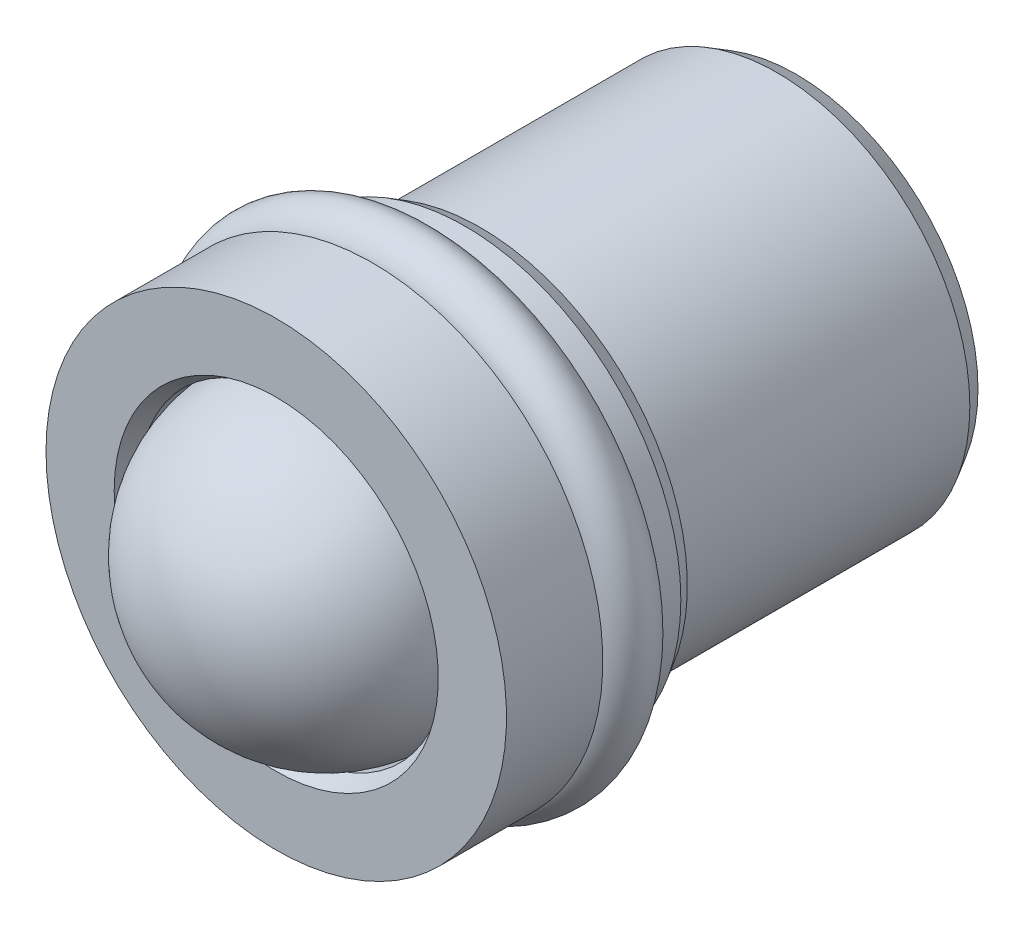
ISO-10303-21;
HEADER;
FILE_DESCRIPTION(('STEP AP214'),'2;1');
FILE_NAME('part.step','',(''),(''),'','','');
FILE_SCHEMA(('AUTOMOTIVE_DESIGN { 1 0 10303 214 1 1 1 1 }'));
ENDSEC;
DATA;
#1=APPLICATION_CONTEXT('core data for automotive mechanical design processes');
#2=APPLICATION_PROTOCOL_DEFINITION('international standard','automotive_design',2000,#1);
#3=PRODUCT_CONTEXT('',#1,'mechanical');
#4=PRODUCT('Part','Part','',(#3));
#5=PRODUCT_RELATED_PRODUCT_CATEGORY('part','',(#4));
#6=PRODUCT_DEFINITION_FORMATION('','',#4);
#7=PRODUCT_DEFINITION_CONTEXT('part definition',#1,'design');
#8=PRODUCT_DEFINITION('design','',#6,#7);
#9=PRODUCT_DEFINITION_SHAPE('','',#8);
#10=(LENGTH_UNIT() NAMED_UNIT(*) SI_UNIT(.MILLI.,.METRE.));
#11=(NAMED_UNIT(*) PLANE_ANGLE_UNIT() SI_UNIT($,.RADIAN.));
#12=(NAMED_UNIT(*) SI_UNIT($,.STERADIAN.) SOLID_ANGLE_UNIT());
#13=UNCERTAINTY_MEASURE_WITH_UNIT(LENGTH_MEASURE(1.E-05),#10,'distance_accuracy_value','');
#14=(GEOMETRIC_REPRESENTATION_CONTEXT(3) GLOBAL_UNCERTAINTY_ASSIGNED_CONTEXT((#13)) GLOBAL_UNIT_ASSIGNED_CONTEXT((#10,
#11,#12)) REPRESENTATION_CONTEXT('',''));
#15=CARTESIAN_POINT('',(0.,0.,0.));
#16=DIRECTION('',(0.,0.,1.));
#17=DIRECTION('',(1.,0.,0.));
#18=AXIS2_PLACEMENT_3D('',#15,#16,#17);
#19=CARTESIAN_POINT('',(0.,0.,-7.7));
#20=DIRECTION('',(0.,0.,1.));
#21=DIRECTION('',(1.,0.,0.));
#22=AXIS2_PLACEMENT_3D('',#19,#20,#21);
#23=CONICAL_SURFACE('',#22,5.,0.523598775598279);
#24=CARTESIAN_POINT('',(0.,0.,-8.2));
#25=DIRECTION('',(0.,0.,-1.));
#26=DIRECTION('',(-1.,0.,0.));
#27=AXIS2_PLACEMENT_3D('',#24,#25,#26);
#28=CIRCLE('',#27,4.7113248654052);
#29=CARTESIAN_POINT('',(-4.7113248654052,0.,-8.2));
#30=VERTEX_POINT('',#29);
#31=EDGE_CURVE('E18',#30,#30,#28,.T.);
#32=ORIENTED_EDGE('',*,*,#31,.F.);
#33=EDGE_LOOP('',(#32));
#34=FACE_BOUND('',#33,.T.);
#35=CARTESIAN_POINT('',(0.,0.,-7.7));
#36=DIRECTION('',(0.,0.,-1.));
#37=DIRECTION('',(-1.,0.,0.));
#38=AXIS2_PLACEMENT_3D('',#35,#36,#37);
#39=CIRCLE('',#38,5.);
#40=CARTESIAN_POINT('',(-5.,0.,-7.7));
#41=VERTEX_POINT('',#40);
#42=EDGE_CURVE('E70',#41,#41,#39,.T.);
#43=ORIENTED_EDGE('',*,*,#42,.T.);
#44=EDGE_LOOP('',(#43));
#45=FACE_BOUND('',#44,.T.);
#46=ADVANCED_FACE('F12',(#34,#45),#23,.T.);
#47=CARTESIAN_POINT('',(0.,4.7113248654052,-8.2));
#48=DIRECTION('',(0.,0.,1.));
#49=DIRECTION('',(1.,0.,0.));
#50=AXIS2_PLACEMENT_3D('',#47,#48,#49);
#51=PLANE('',#50);
#52=ORIENTED_EDGE('',*,*,#31,.T.);
#53=EDGE_LOOP('',(#52));
#54=FACE_BOUND('',#53,.T.);
#55=ADVANCED_FACE('F168',(#54),#51,.F.);
#56=CARTESIAN_POINT('',(0.,0.,5.3));
#57=DIRECTION('',(0.,0.,-1.));
#58=DIRECTION('',(-1.,0.,0.));
#59=AXIS2_PLACEMENT_3D('',#56,#57,#58);
#60=CYLINDRICAL_SURFACE('',#59,3.975);
#61=CARTESIAN_POINT('',(0.,0.,4.4465142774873));
#62=DIRECTION('',(0.,0.,-1.));
#63=DIRECTION('',(-1.,0.,0.));
#64=AXIS2_PLACEMENT_3D('',#61,#62,#63);
#65=CIRCLE('',#64,3.975);
#66=CARTESIAN_POINT('',(-3.975,0.,4.4465142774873));
#67=VERTEX_POINT('',#66);
#68=EDGE_CURVE('E8',#67,#67,#65,.T.);
#69=ORIENTED_EDGE('',*,*,#68,.T.);
#70=EDGE_LOOP('',(#69));
#71=FACE_BOUND('',#70,.T.);
#72=CARTESIAN_POINT('',(0.,0.,4.9));
#73=DIRECTION('',(0.,0.,-1.));
#74=DIRECTION('',(-1.,0.,0.));
#75=AXIS2_PLACEMENT_3D('',#72,#73,#74);
#76=CIRCLE('',#75,3.975);
#77=CARTESIAN_POINT('',(-3.975,0.,4.9));
#78=VERTEX_POINT('',#77);
#79=EDGE_CURVE('E22',#78,#78,#76,.T.);
#80=ORIENTED_EDGE('',*,*,#79,.F.);
#81=EDGE_LOOP('',(#80));
#82=FACE_BOUND('',#81,.T.);
#83=ADVANCED_FACE('F163',(#71,#82),#60,.F.);
#84=CARTESIAN_POINT('',(0.,0.,4.9));
#85=DIRECTION('',(0.,0.,1.));
#86=DIRECTION('',(1.,0.,0.));
#87=AXIS2_PLACEMENT_3D('',#84,#85,#86);
#88=CONICAL_SURFACE('',#87,3.975,0.523598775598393);
#89=CARTESIAN_POINT('',(0.,0.,5.3));
#90=DIRECTION('',(0.,0.,-1.));
#91=DIRECTION('',(-1.,0.,0.));
#92=AXIS2_PLACEMENT_3D('',#89,#90,#91);
#93=CIRCLE('',#92,4.2059401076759);
#94=CARTESIAN_POINT('',(-4.2059401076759,0.,5.3));
#95=VERTEX_POINT('',#94);
#96=EDGE_CURVE('E26',#95,#95,#93,.T.);
#97=ORIENTED_EDGE('',*,*,#96,.F.);
#98=EDGE_LOOP('',(#97));
#99=FACE_BOUND('',#98,.T.);
#100=ORIENTED_EDGE('',*,*,#79,.T.);
#101=EDGE_LOOP('',(#100));
#102=FACE_BOUND('',#101,.T.);
#103=ADVANCED_FACE('F157',(#99,#102),#88,.F.);
#104=CARTESIAN_POINT('',(0.,4.2059401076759,5.3));
#105=DIRECTION('',(0.,0.,-1.));
#106=DIRECTION('',(-1.,0.,0.));
#107=AXIS2_PLACEMENT_3D('',#104,#105,#106);
#108=PLANE('',#107);
#109=CARTESIAN_POINT('',(0.,0.,5.3));
#110=DIRECTION('',(0.,0.,-1.));
#111=DIRECTION('',(-1.,0.,0.));
#112=AXIS2_PLACEMENT_3D('',#109,#110,#111);
#113=CIRCLE('',#112,5.975);
#114=CARTESIAN_POINT('',(-5.975,0.,5.3));
#115=VERTEX_POINT('',#114);
#116=EDGE_CURVE('E31',#115,#115,#113,.T.);
#117=ORIENTED_EDGE('',*,*,#116,.F.);
#118=EDGE_LOOP('',(#117));
#119=FACE_BOUND('',#118,.T.);
#120=ORIENTED_EDGE('',*,*,#96,.T.);
#121=EDGE_LOOP('',(#120));
#122=FACE_BOUND('',#121,.T.);
#123=ADVANCED_FACE('F151',(#119,#122),#108,.F.);
#124=CARTESIAN_POINT('',(0.,0.,5.3));
#125=DIRECTION('',(0.,0.,-1.));
#126=DIRECTION('',(-1.,0.,0.));
#127=AXIS2_PLACEMENT_3D('',#124,#125,#126);
#128=CYLINDRICAL_SURFACE('',#127,5.975);
#129=CARTESIAN_POINT('',(0.,0.,2.8));
#130=DIRECTION('',(0.,0.,-1.));
#131=DIRECTION('',(-1.,0.,0.));
#132=AXIS2_PLACEMENT_3D('',#129,#130,#131);
#133=CIRCLE('',#132,5.975);
#134=CARTESIAN_POINT('',(-5.975,0.,2.8));
#135=VERTEX_POINT('',#134);
#136=EDGE_CURVE('E34',#135,#135,#133,.T.);
#137=ORIENTED_EDGE('',*,*,#136,.F.);
#138=EDGE_LOOP('',(#137));
#139=FACE_BOUND('',#138,.T.);
#140=ORIENTED_EDGE('',*,*,#116,.T.);
#141=EDGE_LOOP('',(#140));
#142=FACE_BOUND('',#141,.T.);
#143=ADVANCED_FACE('F145',(#139,#142),#128,.T.);
#144=CARTESIAN_POINT('',(0.,5.975,2.8));
#145=DIRECTION('',(0.,0.,1.));
#146=DIRECTION('',(1.,0.,0.));
#147=AXIS2_PLACEMENT_3D('',#144,#145,#146);
#148=PLANE('',#147);
#149=CARTESIAN_POINT('',(0.,0.,2.8));
#150=DIRECTION('',(0.,0.,-1.));
#151=DIRECTION('',(-1.,0.,0.));
#152=AXIS2_PLACEMENT_3D('',#149,#150,#151);
#153=CIRCLE('',#152,4.825);
#154=CARTESIAN_POINT('',(-4.825,0.,2.8));
#155=VERTEX_POINT('',#154);
#156=EDGE_CURVE('E37',#155,#155,#153,.T.);
#157=ORIENTED_EDGE('',*,*,#156,.F.);
#158=EDGE_LOOP('',(#157));
#159=FACE_BOUND('',#158,.T.);
#160=ORIENTED_EDGE('',*,*,#136,.T.);
#161=EDGE_LOOP('',(#160));
#162=FACE_BOUND('',#161,.T.);
#163=ADVANCED_FACE('F139',(#159,#162),#148,.F.);
#164=CARTESIAN_POINT('',(0.,0.,5.3));
#165=DIRECTION('',(0.,0.,-1.));
#166=DIRECTION('',(-1.,0.,0.));
#167=AXIS2_PLACEMENT_3D('',#164,#165,#166);
#168=CYLINDRICAL_SURFACE('',#167,4.825);
#169=CARTESIAN_POINT('',(0.,0.,2.65));
#170=DIRECTION('',(0.,0.,-1.));
#171=DIRECTION('',(-1.,0.,0.));
#172=AXIS2_PLACEMENT_3D('',#169,#170,#171);
#173=CIRCLE('',#172,4.825);
#174=CARTESIAN_POINT('',(-4.825,0.,2.65));
#175=VERTEX_POINT('',#174);
#176=EDGE_CURVE('E40',#175,#175,#173,.T.);
#177=ORIENTED_EDGE('',*,*,#176,.F.);
#178=EDGE_LOOP('',(#177));
#179=FACE_BOUND('',#178,.T.);
#180=ORIENTED_EDGE('',*,*,#156,.T.);
#181=EDGE_LOOP('',(#180));
#182=FACE_BOUND('',#181,.T.);
#183=ADVANCED_FACE('F133',(#179,#182),#168,.T.);
#184=CARTESIAN_POINT('',(0.,4.825,2.65));
#185=DIRECTION('',(0.,0.,-1.));
#186=DIRECTION('',(-1.,0.,0.));
#187=AXIS2_PLACEMENT_3D('',#184,#185,#186);
#188=PLANE('',#187);
#189=CARTESIAN_POINT('',(0.,0.,2.65));
#190=DIRECTION('',(0.,0.,-1.));
#191=DIRECTION('',(-1.,0.,0.));
#192=AXIS2_PLACEMENT_3D('',#189,#190,#191);
#193=CIRCLE('',#192,5.575);
#194=CARTESIAN_POINT('',(-5.575,0.,2.65));
#195=VERTEX_POINT('',#194);
#196=EDGE_CURVE('E43',#195,#195,#193,.T.);
#197=ORIENTED_EDGE('',*,*,#196,.F.);
#198=EDGE_LOOP('',(#197));
#199=FACE_BOUND('',#198,.T.);
#200=ORIENTED_EDGE('',*,*,#176,.T.);
#201=EDGE_LOOP('',(#200));
#202=FACE_BOUND('',#201,.T.);
#203=ADVANCED_FACE('F127',(#199,#202),#188,.F.);
#204=CARTESIAN_POINT('',(0.,0.,1.9));
#205=DIRECTION('',(0.,0.,-1.));
#206=DIRECTION('',(-1.,0.,0.));
#207=AXIS2_PLACEMENT_3D('',#204,#205,#206);
#208=TOROIDAL_SURFACE('',#207,5.575,0.750000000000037);
#209=CARTESIAN_POINT('',(0.,0.,1.15));
#210=DIRECTION('',(0.,0.,-1.));
#211=DIRECTION('',(-1.,0.,0.));
#212=AXIS2_PLACEMENT_3D('',#209,#210,#211);
#213=CIRCLE('',#212,5.575);
#214=CARTESIAN_POINT('',(-5.575,0.,1.15));
#215=VERTEX_POINT('',#214);
#216=EDGE_CURVE('E46',#215,#215,#213,.T.);
#217=ORIENTED_EDGE('',*,*,#216,.F.);
#218=EDGE_LOOP('',(#217));
#219=FACE_BOUND('',#218,.T.);
#220=ORIENTED_EDGE('',*,*,#196,.T.);
#221=EDGE_LOOP('',(#220));
#222=FACE_BOUND('',#221,.T.);
#223=ADVANCED_FACE('F121',(#219,#222),#208,.T.);
#224=CARTESIAN_POINT('',(0.,5.575,1.15));
#225=DIRECTION('',(0.,0.,1.));
#226=DIRECTION('',(1.,0.,0.));
#227=AXIS2_PLACEMENT_3D('',#224,#225,#226);
#228=PLANE('',#227);
#229=CARTESIAN_POINT('',(0.,0.,1.15));
#230=DIRECTION('',(0.,0.,-1.));
#231=DIRECTION('',(-1.,0.,0.));
#232=AXIS2_PLACEMENT_3D('',#229,#230,#231);
#233=CIRCLE('',#232,4.825);
#234=CARTESIAN_POINT('',(-4.825,0.,1.15));
#235=VERTEX_POINT('',#234);
#236=EDGE_CURVE('E49',#235,#235,#233,.T.);
#237=ORIENTED_EDGE('',*,*,#236,.F.);
#238=EDGE_LOOP('',(#237));
#239=FACE_BOUND('',#238,.T.);
#240=ORIENTED_EDGE('',*,*,#216,.T.);
#241=EDGE_LOOP('',(#240));
#242=FACE_BOUND('',#241,.T.);
#243=ADVANCED_FACE('F115',(#239,#242),#228,.F.);
#244=CARTESIAN_POINT('',(0.,0.,5.3));
#245=DIRECTION('',(0.,0.,-1.));
#246=DIRECTION('',(-1.,0.,0.));
#247=AXIS2_PLACEMENT_3D('',#244,#245,#246);
#248=CYLINDRICAL_SURFACE('',#247,4.825);
#249=CARTESIAN_POINT('',(0.,0.,1.));
#250=DIRECTION('',(0.,0.,-1.));
#251=DIRECTION('',(-1.,0.,0.));
#252=AXIS2_PLACEMENT_3D('',#249,#250,#251);
#253=CIRCLE('',#252,4.825);
#254=CARTESIAN_POINT('',(-4.825,0.,1.));
#255=VERTEX_POINT('',#254);
#256=EDGE_CURVE('E52',#255,#255,#253,.T.);
#257=ORIENTED_EDGE('',*,*,#256,.F.);
#258=EDGE_LOOP('',(#257));
#259=FACE_BOUND('',#258,.T.);
#260=ORIENTED_EDGE('',*,*,#236,.T.);
#261=EDGE_LOOP('',(#260));
#262=FACE_BOUND('',#261,.T.);
#263=ADVANCED_FACE('F109',(#259,#262),#248,.T.);
#264=CARTESIAN_POINT('',(0.,4.825,1.));
#265=DIRECTION('',(0.,0.,-1.));
#266=DIRECTION('',(-1.,0.,0.));
#267=AXIS2_PLACEMENT_3D('',#264,#265,#266);
#268=PLANE('',#267);
#269=CARTESIAN_POINT('',(0.,0.,1.));
#270=DIRECTION('',(0.,0.,-1.));
#271=DIRECTION('',(-1.,0.,0.));
#272=AXIS2_PLACEMENT_3D('',#269,#270,#271);
#273=CIRCLE('',#272,5.6);
#274=CARTESIAN_POINT('',(-5.6,0.,1.));
#275=VERTEX_POINT('',#274);
#276=EDGE_CURVE('E55',#275,#275,#273,.T.);
#277=ORIENTED_EDGE('',*,*,#276,.F.);
#278=EDGE_LOOP('',(#277));
#279=FACE_BOUND('',#278,.T.);
#280=ORIENTED_EDGE('',*,*,#256,.T.);
#281=EDGE_LOOP('',(#280));
#282=FACE_BOUND('',#281,.T.);
#283=ADVANCED_FACE('F103',(#279,#282),#268,.F.);
#284=CARTESIAN_POINT('',(0.,0.,5.3));
#285=DIRECTION('',(0.,0.,-1.));
#286=DIRECTION('',(-1.,0.,0.));
#287=AXIS2_PLACEMENT_3D('',#284,#285,#286);
#288=CYLINDRICAL_SURFACE('',#287,5.6);
#289=CARTESIAN_POINT('',(0.,0.,0.4));
#290=DIRECTION('',(0.,0.,-1.));
#291=DIRECTION('',(-1.,0.,0.));
#292=AXIS2_PLACEMENT_3D('',#289,#290,#291);
#293=CIRCLE('',#292,5.6);
#294=CARTESIAN_POINT('',(-5.6,0.,0.4));
#295=VERTEX_POINT('',#294);
#296=EDGE_CURVE('E58',#295,#295,#293,.T.);
#297=ORIENTED_EDGE('',*,*,#296,.F.);
#298=EDGE_LOOP('',(#297));
#299=FACE_BOUND('',#298,.T.);
#300=ORIENTED_EDGE('',*,*,#276,.T.);
#301=EDGE_LOOP('',(#300));
#302=FACE_BOUND('',#301,.T.);
#303=ADVANCED_FACE('F97',(#299,#302),#288,.T.);
#304=CARTESIAN_POINT('',(0.,0.,0.4));
#305=DIRECTION('',(0.,0.,1.));
#306=DIRECTION('',(1.,0.,0.));
#307=AXIS2_PLACEMENT_3D('',#304,#305,#306);
#308=CONICAL_SURFACE('',#307,5.6,0.523598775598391);
#309=CARTESIAN_POINT('',(0.,0.,0.));
#310=DIRECTION('',(0.,0.,-1.));
#311=DIRECTION('',(-1.,0.,0.));
#312=AXIS2_PLACEMENT_3D('',#309,#310,#311);
#313=CIRCLE('',#312,5.3690598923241);
#314=CARTESIAN_POINT('',(-5.3690598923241,0.,0.));
#315=VERTEX_POINT('',#314);
#316=EDGE_CURVE('E61',#315,#315,#313,.T.);
#317=ORIENTED_EDGE('',*,*,#316,.F.);
#318=EDGE_LOOP('',(#317));
#319=FACE_BOUND('',#318,.T.);
#320=ORIENTED_EDGE('',*,*,#296,.T.);
#321=EDGE_LOOP('',(#320));
#322=FACE_BOUND('',#321,.T.);
#323=ADVANCED_FACE('F91',(#319,#322),#308,.T.);
#324=CARTESIAN_POINT('',(0.,5.3690598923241,0.));
#325=DIRECTION('',(0.,0.,1.));
#326=DIRECTION('',(1.,0.,0.));
#327=AXIS2_PLACEMENT_3D('',#324,#325,#326);
#328=PLANE('',#327);
#329=CARTESIAN_POINT('',(0.,0.,0.));
#330=DIRECTION('',(0.,0.,-1.));
#331=DIRECTION('',(-1.,0.,0.));
#332=AXIS2_PLACEMENT_3D('',#329,#330,#331);
#333=CIRCLE('',#332,5.2);
#334=CARTESIAN_POINT('',(-5.2,0.,0.));
#335=VERTEX_POINT('',#334);
#336=EDGE_CURVE('E64',#335,#335,#333,.T.);
#337=ORIENTED_EDGE('',*,*,#336,.F.);
#338=EDGE_LOOP('',(#337));
#339=FACE_BOUND('',#338,.T.);
#340=ORIENTED_EDGE('',*,*,#316,.T.);
#341=EDGE_LOOP('',(#340));
#342=FACE_BOUND('',#341,.T.);
#343=ADVANCED_FACE('F85',(#339,#342),#328,.F.);
#344=CARTESIAN_POINT('',(0.,0.,-0.2));
#345=DIRECTION('',(0.,0.,-1.));
#346=DIRECTION('',(-1.,0.,0.));
#347=AXIS2_PLACEMENT_3D('',#344,#345,#346);
#348=TOROIDAL_SURFACE('',#347,5.2,0.200000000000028);
#349=CARTESIAN_POINT('',(0.,0.,-0.2));
#350=DIRECTION('',(0.,0.,-1.));
#351=DIRECTION('',(-1.,0.,0.));
#352=AXIS2_PLACEMENT_3D('',#349,#350,#351);
#353=CIRCLE('',#352,5.);
#354=CARTESIAN_POINT('',(-5.,0.,-0.2));
#355=VERTEX_POINT('',#354);
#356=EDGE_CURVE('E67',#355,#355,#353,.T.);
#357=ORIENTED_EDGE('',*,*,#356,.F.);
#358=EDGE_LOOP('',(#357));
#359=FACE_BOUND('',#358,.T.);
#360=ORIENTED_EDGE('',*,*,#336,.T.);
#361=EDGE_LOOP('',(#360));
#362=FACE_BOUND('',#361,.T.);
#363=ADVANCED_FACE('F79',(#359,#362),#348,.F.);
#364=CARTESIAN_POINT('',(0.,0.,5.3));
#365=DIRECTION('',(0.,0.,-1.));
#366=DIRECTION('',(-1.,0.,0.));
#367=AXIS2_PLACEMENT_3D('',#364,#365,#366);
#368=CYLINDRICAL_SURFACE('',#367,5.);
#369=ORIENTED_EDGE('',*,*,#42,.F.);
#370=EDGE_LOOP('',(#369));
#371=FACE_BOUND('',#370,.T.);
#372=ORIENTED_EDGE('',*,*,#356,.T.);
#373=EDGE_LOOP('',(#372));
#374=FACE_BOUND('',#373,.T.);
#375=ADVANCED_FACE('F75',(#371,#374),#368,.T.);
#376=CARTESIAN_POINT('',(0.,0.,4.));
#377=DIRECTION('',(0.,0.,-1.));
#378=DIRECTION('',(0.,-1.,0.));
#379=AXIS2_PLACEMENT_3D('',#376,#377,#378);
#380=SPHERICAL_SURFACE('',#379,4.);
#381=ORIENTED_EDGE('',*,*,#68,.F.);
#382=EDGE_LOOP('',(#381));
#383=FACE_BOUND('',#382,.T.);
#384=ADVANCED_FACE('F78',(#383),#380,.T.);
#385=CLOSED_SHELL('',(#46,#55,#83,#103,#123,#143,#163,#183,#203,#223,#243,#263,#283,#303,#323,
#343,#363,#375,#384));
#386=MANIFOLD_SOLID_BREP('B1',#385);
#387=ADVANCED_BREP_SHAPE_REPRESENTATION('',(#18,#386),#14);
#388=SHAPE_DEFINITION_REPRESENTATION(#9,#387);
ENDSEC;
END-ISO-10303-21;
